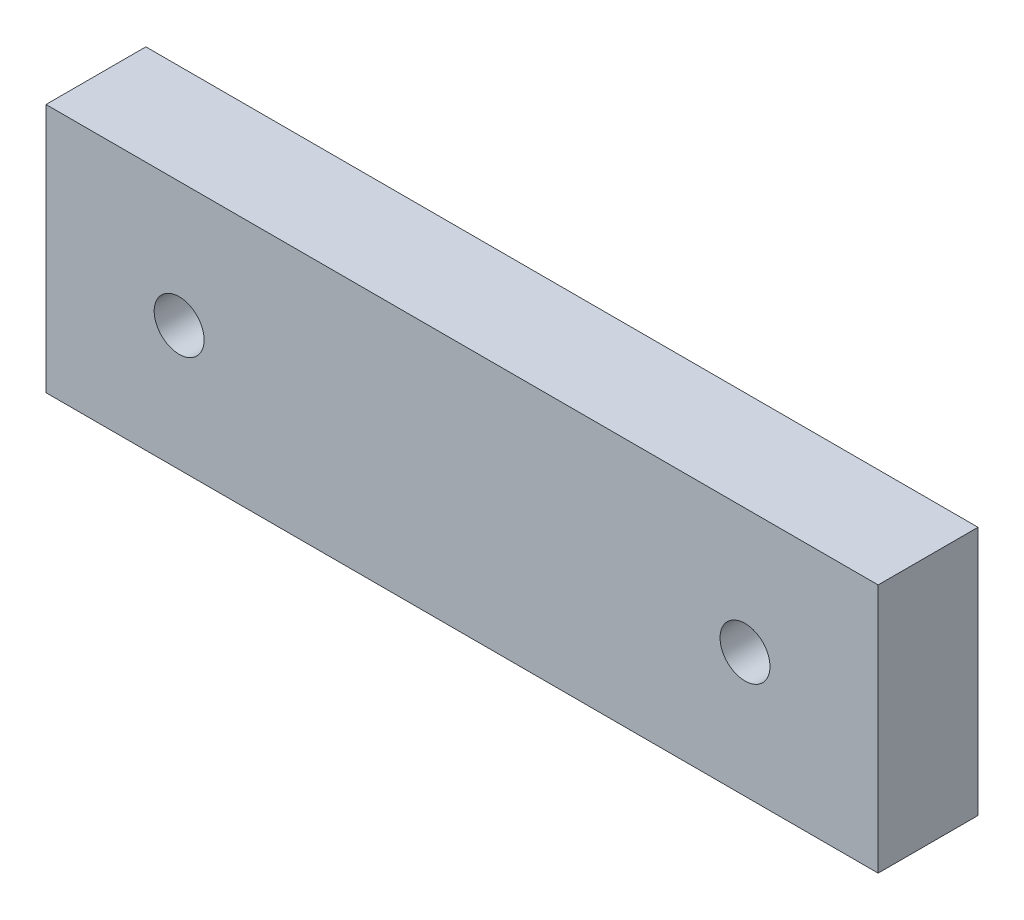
from build123d import *

# Parameters (mm, degrees)
ESQUISSE1_W      = 50
ESQUISSE1_H      = 15
ESQUISSE1_R      = 1.5
EXTRUSION1_DEPTH = 6


with BuildPart() as part:
    # Esquisse1 → Extrusion1 (new body)
    with BuildSketch(Plane.XY):
        with Locations((25, 7.5)):
            Rectangle(ESQUISSE1_W, ESQUISSE1_H)
        with Locations((8, 7.5)):
            Circle(ESQUISSE1_R, mode=Mode.SUBTRACT)
        with Locations((42, 7.5)):
            Circle(ESQUISSE1_R, mode=Mode.SUBTRACT)
    extrude(amount=EXTRUSION1_DEPTH)


solid = part.part
